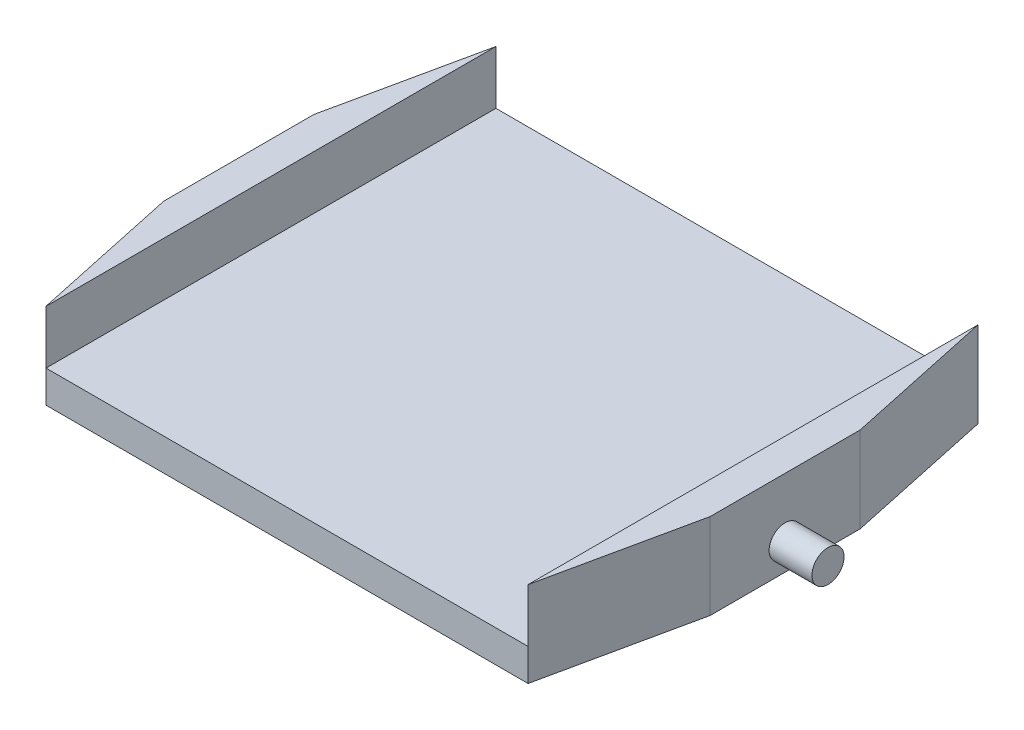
ISO-10303-21;
HEADER;
FILE_DESCRIPTION(('STEP AP214'),'2;1');
FILE_NAME('part.step','',(''),(''),'','','');
FILE_SCHEMA(('AUTOMOTIVE_DESIGN { 1 0 10303 214 1 1 1 1 }'));
ENDSEC;
DATA;
#1=APPLICATION_CONTEXT('core data for automotive mechanical design processes');
#2=APPLICATION_PROTOCOL_DEFINITION('international standard','automotive_design',2000,#1);
#3=PRODUCT_CONTEXT('',#1,'mechanical');
#4=PRODUCT('Part','Part','',(#3));
#5=PRODUCT_RELATED_PRODUCT_CATEGORY('part','',(#4));
#6=PRODUCT_DEFINITION_FORMATION('','',#4);
#7=PRODUCT_DEFINITION_CONTEXT('part definition',#1,'design');
#8=PRODUCT_DEFINITION('design','',#6,#7);
#9=PRODUCT_DEFINITION_SHAPE('','',#8);
#10=(LENGTH_UNIT() NAMED_UNIT(*) SI_UNIT(.MILLI.,.METRE.));
#11=(NAMED_UNIT(*) PLANE_ANGLE_UNIT() SI_UNIT($,.RADIAN.));
#12=(NAMED_UNIT(*) SI_UNIT($,.STERADIAN.) SOLID_ANGLE_UNIT());
#13=UNCERTAINTY_MEASURE_WITH_UNIT(LENGTH_MEASURE(1.E-05),#10,'distance_accuracy_value','');
#14=(GEOMETRIC_REPRESENTATION_CONTEXT(3) GLOBAL_UNCERTAINTY_ASSIGNED_CONTEXT((#13)) GLOBAL_UNIT_ASSIGNED_CONTEXT((#10,
#11,#12)) REPRESENTATION_CONTEXT('',''));
#15=CARTESIAN_POINT('',(0.,0.,0.));
#16=DIRECTION('',(0.,0.,1.));
#17=DIRECTION('',(1.,0.,0.));
#18=AXIS2_PLACEMENT_3D('',#15,#16,#17);
#19=CARTESIAN_POINT('',(0.,3.,0.));
#20=DIRECTION('',(0.,-1.,0.));
#21=DIRECTION('',(0.,0.,-1.));
#22=AXIS2_PLACEMENT_3D('',#19,#20,#21);
#23=PLANE('',#22);
#24=DIRECTION('',(0.,0.,1.));
#25=VECTOR('',#24,1.);
#26=CARTESIAN_POINT('',(45.,3.,-42.));
#27=LINE('',#26,#25);
#28=CARTESIAN_POINT('',(45.,3.,-42.));
#29=VERTEX_POINT('',#28);
#30=CARTESIAN_POINT('',(45.,3.,0.));
#31=VERTEX_POINT('',#30);
#32=EDGE_CURVE('E206',#29,#31,#27,.T.);
#33=ORIENTED_EDGE('',*,*,#32,.F.);
#34=DIRECTION('',(-1.,0.,0.));
#35=VECTOR('',#34,1.);
#36=CARTESIAN_POINT('',(0.,3.,-42.));
#37=LINE('',#36,#35);
#38=CARTESIAN_POINT('',(0.,3.,-42.));
#39=VERTEX_POINT('',#38);
#40=EDGE_CURVE('E104',#29,#39,#37,.T.);
#41=ORIENTED_EDGE('',*,*,#40,.T.);
#42=DIRECTION('',(0.,0.,-1.));
#43=VECTOR('',#42,1.);
#44=CARTESIAN_POINT('',(0.,3.,-42.));
#45=LINE('',#44,#43);
#46=CARTESIAN_POINT('',(0.,3.,0.));
#47=VERTEX_POINT('',#46);
#48=EDGE_CURVE('E229',#47,#39,#45,.T.);
#49=ORIENTED_EDGE('',*,*,#48,.F.);
#50=DIRECTION('',(1.,0.,0.));
#51=VECTOR('',#50,1.);
#52=CARTESIAN_POINT('',(0.,3.,0.));
#53=LINE('',#52,#51);
#54=EDGE_CURVE('E50',#47,#31,#53,.T.);
#55=ORIENTED_EDGE('',*,*,#54,.T.);
#56=EDGE_LOOP('',(#33,#41,#49,#55));
#57=FACE_BOUND('',#56,.T.);
#58=ADVANCED_FACE('F33',(#57),#23,.F.);
#59=CARTESIAN_POINT('',(0.,3.,0.));
#60=DIRECTION('',(0.977802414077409,0.,-0.209529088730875));
#61=DIRECTION('',(-0.209529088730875,0.,-0.977802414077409));
#62=AXIS2_PLACEMENT_3D('',#59,#60,#61);
#63=PLANE('',#62);
#64=DIRECTION('',(0.209529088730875,0.,0.977802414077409));
#65=VECTOR('',#64,1.);
#66=CARTESIAN_POINT('',(0.,0.,0.));
#67=LINE('',#66,#65);
#68=CARTESIAN_POINT('',(-3.00000000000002,0.,-14.));
#69=VERTEX_POINT('',#68);
#70=CARTESIAN_POINT('',(0.,0.,0.));
#71=VERTEX_POINT('',#70);
#72=EDGE_CURVE('E100',#69,#71,#67,.T.);
#73=ORIENTED_EDGE('',*,*,#72,.T.);
#74=DIRECTION('',(0.,-1.,0.));
#75=VECTOR('',#74,1.);
#76=CARTESIAN_POINT('',(0.,3.,0.));
#77=LINE('',#76,#75);
#78=EDGE_CURVE('E143',#47,#71,#77,.T.);
#79=ORIENTED_EDGE('',*,*,#78,.F.);
#80=DIRECTION('',(0.,-1.,0.));
#81=VECTOR('',#80,1.);
#82=CARTESIAN_POINT('',(0.,8.,0.));
#83=LINE('',#82,#81);
#84=CARTESIAN_POINT('',(0.,8.,0.));
#85=VERTEX_POINT('',#84);
#86=EDGE_CURVE('E110',#85,#47,#83,.T.);
#87=ORIENTED_EDGE('',*,*,#86,.F.);
#88=DIRECTION('',(0.209529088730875,0.,0.977802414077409));
#89=VECTOR('',#88,1.);
#90=CARTESIAN_POINT('',(0.,8.,0.));
#91=LINE('',#90,#89);
#92=CARTESIAN_POINT('',(-3.00000000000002,8.,-14.));
#93=VERTEX_POINT('',#92);
#94=EDGE_CURVE('E103',#93,#85,#91,.T.);
#95=ORIENTED_EDGE('',*,*,#94,.F.);
#96=DIRECTION('',(0.,-1.,0.));
#97=VECTOR('',#96,1.);
#98=CARTESIAN_POINT('',(-3.00000000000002,3.,-14.));
#99=LINE('',#98,#97);
#100=EDGE_CURVE('E90',#93,#69,#99,.T.);
#101=ORIENTED_EDGE('',*,*,#100,.T.);
#102=EDGE_LOOP('',(#73,#79,#87,#95,#101));
#103=FACE_BOUND('',#102,.T.);
#104=ADVANCED_FACE('F35',(#103),#63,.F.);
#105=CARTESIAN_POINT('',(0.,3.,0.));
#106=DIRECTION('',(0.,0.,-1.));
#107=DIRECTION('',(-1.,0.,0.));
#108=AXIS2_PLACEMENT_3D('',#105,#106,#107);
#109=PLANE('',#108);
#110=DIRECTION('',(1.,0.,0.));
#111=VECTOR('',#110,1.);
#112=CARTESIAN_POINT('',(0.,0.,0.));
#113=LINE('',#112,#111);
#114=CARTESIAN_POINT('',(45.,0.,0.));
#115=VERTEX_POINT('',#114);
#116=EDGE_CURVE('E108',#71,#115,#113,.T.);
#117=ORIENTED_EDGE('',*,*,#116,.T.);
#118=DIRECTION('',(0.,-1.,0.));
#119=VECTOR('',#118,1.);
#120=CARTESIAN_POINT('',(45.,3.,0.));
#121=LINE('',#120,#119);
#122=EDGE_CURVE('E140',#31,#115,#121,.T.);
#123=ORIENTED_EDGE('',*,*,#122,.F.);
#124=ORIENTED_EDGE('',*,*,#54,.F.);
#125=ORIENTED_EDGE('',*,*,#78,.T.);
#126=EDGE_LOOP('',(#117,#123,#124,#125));
#127=FACE_BOUND('',#126,.T.);
#128=ADVANCED_FACE('F167',(#127),#109,.F.);
#129=CARTESIAN_POINT('',(45.,3.,0.));
#130=DIRECTION('',(-0.977802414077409,0.,-0.209529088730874));
#131=DIRECTION('',(-0.209529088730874,0.,0.97780241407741));
#132=AXIS2_PLACEMENT_3D('',#129,#130,#131);
#133=PLANE('',#132);
#134=DIRECTION('',(0.209529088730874,0.,-0.977802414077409));
#135=VECTOR('',#134,1.);
#136=CARTESIAN_POINT('',(45.,0.,0.));
#137=LINE('',#136,#135);
#138=CARTESIAN_POINT('',(48.,0.,-14.));
#139=VERTEX_POINT('',#138);
#140=EDGE_CURVE('E112',#115,#139,#137,.T.);
#141=ORIENTED_EDGE('',*,*,#140,.T.);
#142=DIRECTION('',(0.,-1.,0.));
#143=VECTOR('',#142,1.);
#144=CARTESIAN_POINT('',(48.,3.,-14.));
#145=LINE('',#144,#143);
#146=CARTESIAN_POINT('',(48.,8.,-14.));
#147=VERTEX_POINT('',#146);
#148=EDGE_CURVE('E137',#147,#139,#145,.T.);
#149=ORIENTED_EDGE('',*,*,#148,.F.);
#150=DIRECTION('',(0.209529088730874,0.,-0.977802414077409));
#151=VECTOR('',#150,1.);
#152=CARTESIAN_POINT('',(45.,8.,0.));
#153=LINE('',#152,#151);
#154=CARTESIAN_POINT('',(45.,8.,0.));
#155=VERTEX_POINT('',#154);
#156=EDGE_CURVE('E215',#155,#147,#153,.T.);
#157=ORIENTED_EDGE('',*,*,#156,.F.);
#158=DIRECTION('',(0.,-1.,0.));
#159=VECTOR('',#158,1.);
#160=CARTESIAN_POINT('',(45.,8.,0.));
#161=LINE('',#160,#159);
#162=EDGE_CURVE('E221',#155,#31,#161,.T.);
#163=ORIENTED_EDGE('',*,*,#162,.T.);
#164=ORIENTED_EDGE('',*,*,#122,.T.);
#165=EDGE_LOOP('',(#141,#149,#157,#163,#164));
#166=FACE_BOUND('',#165,.T.);
#167=ADVANCED_FACE('F268',(#166),#133,.F.);
#168=CARTESIAN_POINT('',(48.,3.,-14.));
#169=DIRECTION('',(-1.,0.,0.));
#170=DIRECTION('',(0.,0.,1.));
#171=AXIS2_PLACEMENT_3D('',#168,#169,#170);
#172=PLANE('',#171);
#173=CARTESIAN_POINT('',(48.,2.5,-21.));
#174=DIRECTION('',(-1.,0.,0.));
#175=DIRECTION('',(0.,0.,1.));
#176=AXIS2_PLACEMENT_3D('',#173,#174,#175);
#177=CIRCLE('',#176,1.5);
#178=CARTESIAN_POINT('',(48.,2.5,-19.5));
#179=VERTEX_POINT('',#178);
#180=EDGE_CURVE('E11',#179,#179,#177,.F.);
#181=ORIENTED_EDGE('',*,*,#180,.F.);
#182=EDGE_LOOP('',(#181));
#183=FACE_BOUND('',#182,.T.);
#184=DIRECTION('',(0.,0.,-1.));
#185=VECTOR('',#184,1.);
#186=CARTESIAN_POINT('',(48.,0.,-14.));
#187=LINE('',#186,#185);
#188=CARTESIAN_POINT('',(48.,0.,-28.));
#189=VERTEX_POINT('',#188);
#190=EDGE_CURVE('E121',#139,#189,#187,.T.);
#191=ORIENTED_EDGE('',*,*,#190,.T.);
#192=DIRECTION('',(0.,-1.,0.));
#193=VECTOR('',#192,1.);
#194=CARTESIAN_POINT('',(48.,3.,-28.));
#195=LINE('',#194,#193);
#196=CARTESIAN_POINT('',(48.,8.,-28.));
#197=VERTEX_POINT('',#196);
#198=EDGE_CURVE('E134',#197,#189,#195,.T.);
#199=ORIENTED_EDGE('',*,*,#198,.F.);
#200=DIRECTION('',(0.,0.,-1.));
#201=VECTOR('',#200,1.);
#202=CARTESIAN_POINT('',(48.,8.,-14.));
#203=LINE('',#202,#201);
#204=EDGE_CURVE('E218',#147,#197,#203,.T.);
#205=ORIENTED_EDGE('',*,*,#204,.F.);
#206=ORIENTED_EDGE('',*,*,#148,.T.);
#207=EDGE_LOOP('',(#191,#199,#205,#206));
#208=FACE_BOUND('',#207,.T.);
#209=ADVANCED_FACE('F278',(#183,#208),#172,.F.);
#210=CARTESIAN_POINT('',(48.,3.,-28.));
#211=DIRECTION('',(-0.977802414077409,0.,0.209529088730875));
#212=DIRECTION('',(0.209529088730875,0.,0.977802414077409));
#213=AXIS2_PLACEMENT_3D('',#210,#211,#212);
#214=PLANE('',#213);
#215=DIRECTION('',(-0.209529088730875,0.,-0.977802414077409));
#216=VECTOR('',#215,1.);
#217=CARTESIAN_POINT('',(48.,0.,-28.));
#218=LINE('',#217,#216);
#219=CARTESIAN_POINT('',(45.,0.,-42.));
#220=VERTEX_POINT('',#219);
#221=EDGE_CURVE('E123',#189,#220,#218,.T.);
#222=ORIENTED_EDGE('',*,*,#221,.T.);
#223=DIRECTION('',(0.,-1.,0.));
#224=VECTOR('',#223,1.);
#225=CARTESIAN_POINT('',(45.,3.,-42.));
#226=LINE('',#225,#224);
#227=EDGE_CURVE('E131',#29,#220,#226,.T.);
#228=ORIENTED_EDGE('',*,*,#227,.F.);
#229=DIRECTION('',(0.,-1.,0.));
#230=VECTOR('',#229,1.);
#231=CARTESIAN_POINT('',(45.,8.,-42.));
#232=LINE('',#231,#230);
#233=CARTESIAN_POINT('',(45.,8.,-42.));
#234=VERTEX_POINT('',#233);
#235=EDGE_CURVE('E226',#234,#29,#232,.T.);
#236=ORIENTED_EDGE('',*,*,#235,.F.);
#237=DIRECTION('',(-0.209529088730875,0.,-0.977802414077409));
#238=VECTOR('',#237,1.);
#239=CARTESIAN_POINT('',(48.,8.,-28.));
#240=LINE('',#239,#238);
#241=EDGE_CURVE('E209',#197,#234,#240,.T.);
#242=ORIENTED_EDGE('',*,*,#241,.F.);
#243=ORIENTED_EDGE('',*,*,#198,.T.);
#244=EDGE_LOOP('',(#222,#228,#236,#242,#243));
#245=FACE_BOUND('',#244,.T.);
#246=ADVANCED_FACE('F282',(#245),#214,.F.);
#247=CARTESIAN_POINT('',(0.,3.,-42.));
#248=DIRECTION('',(0.,0.,1.));
#249=DIRECTION('',(1.,0.,0.));
#250=AXIS2_PLACEMENT_3D('',#247,#248,#249);
#251=PLANE('',#250);
#252=DIRECTION('',(-1.,0.,0.));
#253=VECTOR('',#252,1.);
#254=CARTESIAN_POINT('',(0.,0.,-42.));
#255=LINE('',#254,#253);
#256=CARTESIAN_POINT('',(0.,0.,-42.));
#257=VERTEX_POINT('',#256);
#258=EDGE_CURVE('E125',#220,#257,#255,.T.);
#259=ORIENTED_EDGE('',*,*,#258,.T.);
#260=DIRECTION('',(0.,-1.,0.));
#261=VECTOR('',#260,1.);
#262=CARTESIAN_POINT('',(0.,3.,-42.));
#263=LINE('',#262,#261);
#264=EDGE_CURVE('E129',#39,#257,#263,.T.);
#265=ORIENTED_EDGE('',*,*,#264,.F.);
#266=ORIENTED_EDGE('',*,*,#40,.F.);
#267=ORIENTED_EDGE('',*,*,#227,.T.);
#268=EDGE_LOOP('',(#259,#265,#266,#267));
#269=FACE_BOUND('',#268,.T.);
#270=ADVANCED_FACE('F160',(#269),#251,.F.);
#271=CARTESIAN_POINT('',(-3.00000000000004,3.,-28.));
#272=DIRECTION('',(0.977802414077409,0.,0.209529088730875));
#273=DIRECTION('',(0.209529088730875,0.,-0.977802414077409));
#274=AXIS2_PLACEMENT_3D('',#271,#272,#273);
#275=PLANE('',#274);
#276=DIRECTION('',(-0.209529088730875,0.,0.977802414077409));
#277=VECTOR('',#276,1.);
#278=CARTESIAN_POINT('',(-3.00000000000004,0.,-28.));
#279=LINE('',#278,#277);
#280=CARTESIAN_POINT('',(-3.00000000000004,0.,-28.));
#281=VERTEX_POINT('',#280);
#282=EDGE_CURVE('E79',#257,#281,#279,.T.);
#283=ORIENTED_EDGE('',*,*,#282,.T.);
#284=DIRECTION('',(0.,-1.,0.));
#285=VECTOR('',#284,1.);
#286=CARTESIAN_POINT('',(-3.00000000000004,3.,-28.));
#287=LINE('',#286,#285);
#288=CARTESIAN_POINT('',(-3.00000000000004,8.,-28.));
#289=VERTEX_POINT('',#288);
#290=EDGE_CURVE('E92',#289,#281,#287,.T.);
#291=ORIENTED_EDGE('',*,*,#290,.F.);
#292=DIRECTION('',(-0.209529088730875,0.,0.977802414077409));
#293=VECTOR('',#292,1.);
#294=CARTESIAN_POINT('',(-3.00000000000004,8.,-28.));
#295=LINE('',#294,#293);
#296=CARTESIAN_POINT('',(0.,8.,-42.));
#297=VERTEX_POINT('',#296);
#298=EDGE_CURVE('E230',#297,#289,#295,.T.);
#299=ORIENTED_EDGE('',*,*,#298,.F.);
#300=DIRECTION('',(0.,-1.,0.));
#301=VECTOR('',#300,1.);
#302=CARTESIAN_POINT('',(0.,8.,-42.));
#303=LINE('',#302,#301);
#304=EDGE_CURVE('E115',#297,#39,#303,.T.);
#305=ORIENTED_EDGE('',*,*,#304,.T.);
#306=ORIENTED_EDGE('',*,*,#264,.T.);
#307=EDGE_LOOP('',(#283,#291,#299,#305,#306));
#308=FACE_BOUND('',#307,.T.);
#309=ADVANCED_FACE('F150',(#308),#275,.F.);
#310=CARTESIAN_POINT('',(-3.00000000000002,3.,-14.));
#311=DIRECTION('',(1.,0.,0.));
#312=DIRECTION('',(0.,0.,-1.));
#313=AXIS2_PLACEMENT_3D('',#310,#311,#312);
#314=PLANE('',#313);
#315=CARTESIAN_POINT('',(-3.00000000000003,2.5,-21.));
#316=DIRECTION('',(1.,0.,0.));
#317=DIRECTION('',(0.,0.,-1.));
#318=AXIS2_PLACEMENT_3D('',#315,#316,#317);
#319=CIRCLE('',#318,1.5);
#320=CARTESIAN_POINT('',(-3.00000000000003,2.5,-22.5));
#321=VERTEX_POINT('',#320);
#322=EDGE_CURVE('E42',#321,#321,#319,.F.);
#323=ORIENTED_EDGE('',*,*,#322,.F.);
#324=EDGE_LOOP('',(#323));
#325=FACE_BOUND('',#324,.T.);
#326=DIRECTION('',(0.,0.,1.));
#327=VECTOR('',#326,1.);
#328=CARTESIAN_POINT('',(-3.00000000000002,0.,-14.));
#329=LINE('',#328,#327);
#330=EDGE_CURVE('E85',#281,#69,#329,.T.);
#331=ORIENTED_EDGE('',*,*,#330,.T.);
#332=ORIENTED_EDGE('',*,*,#100,.F.);
#333=DIRECTION('',(0.,0.,1.));
#334=VECTOR('',#333,1.);
#335=CARTESIAN_POINT('',(-3.00000000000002,8.,-14.));
#336=LINE('',#335,#334);
#337=EDGE_CURVE('E233',#289,#93,#336,.T.);
#338=ORIENTED_EDGE('',*,*,#337,.F.);
#339=ORIENTED_EDGE('',*,*,#290,.T.);
#340=EDGE_LOOP('',(#331,#332,#338,#339));
#341=FACE_BOUND('',#340,.T.);
#342=ADVANCED_FACE('F87',(#325,#341),#314,.F.);
#343=CARTESIAN_POINT('',(0.,0.,0.));
#344=DIRECTION('',(0.,-1.,0.));
#345=DIRECTION('',(0.,0.,-1.));
#346=AXIS2_PLACEMENT_3D('',#343,#344,#345);
#347=PLANE('',#346);
#348=ORIENTED_EDGE('',*,*,#72,.F.);
#349=ORIENTED_EDGE('',*,*,#330,.F.);
#350=ORIENTED_EDGE('',*,*,#282,.F.);
#351=ORIENTED_EDGE('',*,*,#258,.F.);
#352=ORIENTED_EDGE('',*,*,#221,.F.);
#353=ORIENTED_EDGE('',*,*,#190,.F.);
#354=ORIENTED_EDGE('',*,*,#140,.F.);
#355=ORIENTED_EDGE('',*,*,#116,.F.);
#356=EDGE_LOOP('',(#348,#349,#350,#351,#352,#353,#354,#355));
#357=FACE_BOUND('',#356,.T.);
#358=ADVANCED_FACE('F106',(#357),#347,.T.);
#359=CARTESIAN_POINT('',(0.,8.,-42.));
#360=DIRECTION('',(-1.,0.,0.));
#361=DIRECTION('',(0.,0.,1.));
#362=AXIS2_PLACEMENT_3D('',#359,#360,#361);
#363=PLANE('',#362);
#364=ORIENTED_EDGE('',*,*,#48,.T.);
#365=ORIENTED_EDGE('',*,*,#304,.F.);
#366=DIRECTION('',(0.,0.,-1.));
#367=VECTOR('',#366,1.);
#368=CARTESIAN_POINT('',(0.,8.,-42.));
#369=LINE('',#368,#367);
#370=EDGE_CURVE('E236',#85,#297,#369,.T.);
#371=ORIENTED_EDGE('',*,*,#370,.F.);
#372=ORIENTED_EDGE('',*,*,#86,.T.);
#373=EDGE_LOOP('',(#364,#365,#371,#372));
#374=FACE_BOUND('',#373,.T.);
#375=ADVANCED_FACE('F157',(#374),#363,.F.);
#376=CARTESIAN_POINT('',(0.,8.,0.));
#377=DIRECTION('',(0.,1.,0.));
#378=DIRECTION('',(0.,0.,1.));
#379=AXIS2_PLACEMENT_3D('',#376,#377,#378);
#380=PLANE('',#379);
#381=ORIENTED_EDGE('',*,*,#298,.T.);
#382=ORIENTED_EDGE('',*,*,#337,.T.);
#383=ORIENTED_EDGE('',*,*,#94,.T.);
#384=ORIENTED_EDGE('',*,*,#370,.T.);
#385=EDGE_LOOP('',(#381,#382,#383,#384));
#386=FACE_BOUND('',#385,.T.);
#387=ADVANCED_FACE('F171',(#386),#380,.T.);
#388=CARTESIAN_POINT('',(45.,8.,-42.));
#389=DIRECTION('',(1.,0.,0.));
#390=DIRECTION('',(0.,0.,-1.));
#391=AXIS2_PLACEMENT_3D('',#388,#389,#390);
#392=PLANE('',#391);
#393=ORIENTED_EDGE('',*,*,#32,.T.);
#394=ORIENTED_EDGE('',*,*,#162,.F.);
#395=DIRECTION('',(0.,0.,1.));
#396=VECTOR('',#395,1.);
#397=CARTESIAN_POINT('',(45.,8.,-42.));
#398=LINE('',#397,#396);
#399=EDGE_CURVE('E212',#234,#155,#398,.T.);
#400=ORIENTED_EDGE('',*,*,#399,.F.);
#401=ORIENTED_EDGE('',*,*,#235,.T.);
#402=EDGE_LOOP('',(#393,#394,#400,#401));
#403=FACE_BOUND('',#402,.T.);
#404=ADVANCED_FACE('F175',(#403),#392,.F.);
#405=CARTESIAN_POINT('',(0.,8.,0.));
#406=DIRECTION('',(0.,-1.,0.));
#407=DIRECTION('',(0.,0.,-1.));
#408=AXIS2_PLACEMENT_3D('',#405,#406,#407);
#409=PLANE('',#408);
#410=ORIENTED_EDGE('',*,*,#241,.T.);
#411=ORIENTED_EDGE('',*,*,#399,.T.);
#412=ORIENTED_EDGE('',*,*,#156,.T.);
#413=ORIENTED_EDGE('',*,*,#204,.T.);
#414=EDGE_LOOP('',(#410,#411,#412,#413));
#415=FACE_BOUND('',#414,.T.);
#416=ADVANCED_FACE('F179',(#415),#409,.F.);
#417=CARTESIAN_POINT('',(-7.00000000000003,2.5,-21.));
#418=DIRECTION('',(1.,0.,0.));
#419=DIRECTION('',(0.,0.,-1.));
#420=AXIS2_PLACEMENT_3D('',#417,#418,#419);
#421=CYLINDRICAL_SURFACE('',#420,1.5);
#422=CARTESIAN_POINT('',(-7.00000000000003,2.5,-21.));
#423=DIRECTION('',(-1.,0.,0.));
#424=DIRECTION('',(0.,0.,1.));
#425=AXIS2_PLACEMENT_3D('',#422,#423,#424);
#426=CIRCLE('',#425,1.5);
#427=CARTESIAN_POINT('',(-7.00000000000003,2.5,-19.5));
#428=VERTEX_POINT('',#427);
#429=EDGE_CURVE('E203',#428,#428,#426,.T.);
#430=ORIENTED_EDGE('',*,*,#429,.F.);
#431=EDGE_LOOP('',(#430));
#432=FACE_BOUND('',#431,.T.);
#433=ORIENTED_EDGE('',*,*,#322,.T.);
#434=EDGE_LOOP('',(#433));
#435=FACE_BOUND('',#434,.T.);
#436=ADVANCED_FACE('F147',(#432,#435),#421,.T.);
#437=CARTESIAN_POINT('',(-7.00000000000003,2.5,-21.));
#438=DIRECTION('',(-1.,0.,0.));
#439=DIRECTION('',(0.,0.,1.));
#440=AXIS2_PLACEMENT_3D('',#437,#438,#439);
#441=PLANE('',#440);
#442=ORIENTED_EDGE('',*,*,#429,.T.);
#443=EDGE_LOOP('',(#442));
#444=FACE_BOUND('',#443,.T.);
#445=ADVANCED_FACE('F186',(#444),#441,.T.);
#446=CARTESIAN_POINT('',(52.,2.5,-21.));
#447=DIRECTION('',(-1.,0.,0.));
#448=DIRECTION('',(0.,0.,1.));
#449=AXIS2_PLACEMENT_3D('',#446,#447,#448);
#450=CYLINDRICAL_SURFACE('',#449,1.5);
#451=CARTESIAN_POINT('',(52.,2.5,-21.));
#452=DIRECTION('',(1.,0.,0.));
#453=DIRECTION('',(0.,0.,-1.));
#454=AXIS2_PLACEMENT_3D('',#451,#452,#453);
#455=CIRCLE('',#454,1.5);
#456=CARTESIAN_POINT('',(52.,2.5,-22.5));
#457=VERTEX_POINT('',#456);
#458=EDGE_CURVE('E202',#457,#457,#455,.T.);
#459=ORIENTED_EDGE('',*,*,#458,.F.);
#460=EDGE_LOOP('',(#459));
#461=FACE_BOUND('',#460,.T.);
#462=ORIENTED_EDGE('',*,*,#180,.T.);
#463=EDGE_LOOP('',(#462));
#464=FACE_BOUND('',#463,.T.);
#465=ADVANCED_FACE('F190',(#461,#464),#450,.T.);
#466=CARTESIAN_POINT('',(52.,2.5,-21.));
#467=DIRECTION('',(1.,0.,0.));
#468=DIRECTION('',(0.,0.,-1.));
#469=AXIS2_PLACEMENT_3D('',#466,#467,#468);
#470=PLANE('',#469);
#471=ORIENTED_EDGE('',*,*,#458,.T.);
#472=EDGE_LOOP('',(#471));
#473=FACE_BOUND('',#472,.T.);
#474=ADVANCED_FACE('F194',(#473),#470,.T.);
#475=CLOSED_SHELL('',(#58,#104,#128,#167,#209,#246,#270,#309,#342,#358,#375,#387,#404,#416,#436,
#445,#465,#474));
#476=MANIFOLD_SOLID_BREP('B2',#475);
#477=ADVANCED_BREP_SHAPE_REPRESENTATION('',(#18,#476),#14);
#478=SHAPE_DEFINITION_REPRESENTATION(#9,#477);
ENDSEC;
END-ISO-10303-21;
